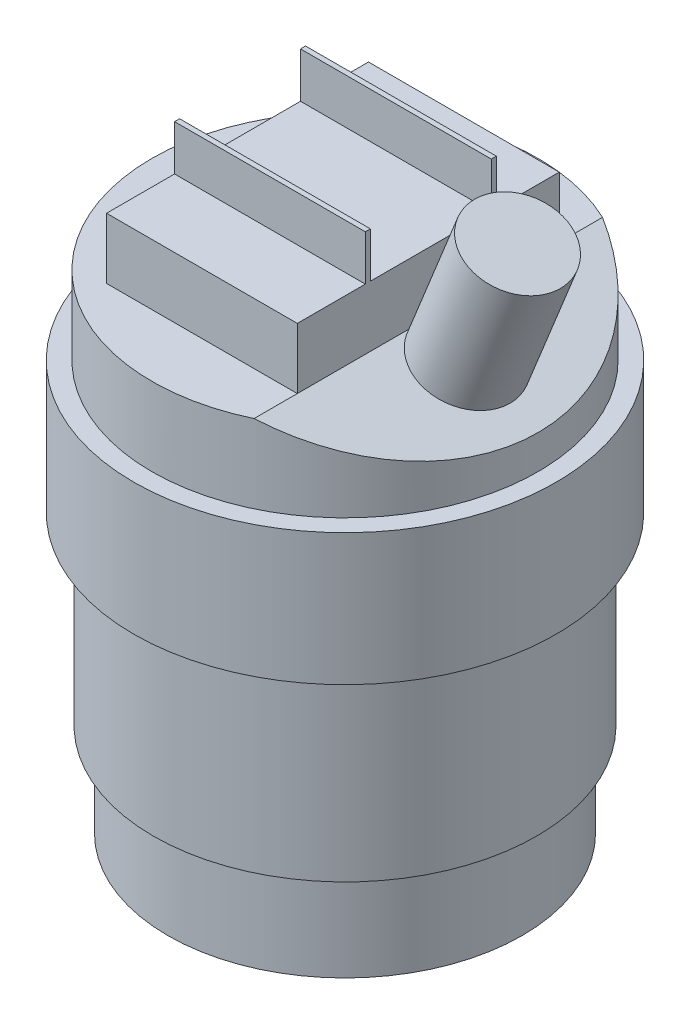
from build123d import *

# Parameters (mm, degrees)
SKETCH1_R               = 13.3985
EXTRUDE1_DEPTH          = 7.0612
SKETCH2_R               = 14.4907
EXTRUDE2_DEPTH          = 13.97
SKETCH3_R               = 15.9766
EXTRUDE3_DEPTH          = 9.9568
SKETCH4_R               = 14.605
EXTRUDE4_DEPTH          = 5.9182
CUT_EXTRUDE1_DEPTH      = 44.273214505
CUT_EXTRUDE1_DEPTH_BACK = 44.273214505
SKETCH6_W               = 14.4272
SKETCH6_H               = 19.812
EXTRUDE5_DEPTH          = 4.5974
SKETCH7_W               = 14.4272
SKETCH7_H               = 0.381
EXTRUDE6_DEPTH          = 3.429
SKETCH8_R               = 3.4925
EXTRUDE7_DEPTH          = 10.16


with BuildPart() as part:
    # Sketch1 → Extrude1 (new body)
    with BuildSketch(Plane(origin=(0, 0, 0), x_dir=(1, 0, 0), z_dir=(0, 1, 0))):
        with Locations(Location((0, 0, 0), (0, 0, 270))):
            Circle(SKETCH1_R)
    extrude(amount=EXTRUDE1_DEPTH)

    # Sketch2 → Extrude2 (add)
    with BuildSketch(Plane(origin=(0, 7.0612, 0), x_dir=(1, 0, 0), z_dir=(0, 1, 0))):
        with Locations(Location((0, 0, 0), (0, 0, 270))):
            Circle(SKETCH2_R)
    extrude(amount=EXTRUDE2_DEPTH)

    # Sketch3 → Extrude3 (add)
    with BuildSketch(Plane(origin=(0, 21.0312, 0), x_dir=(1, 0, 0), z_dir=(0, 1, 0))):
        with Locations(Location((0, 0, 0), (0, 0, 270))):
            Circle(SKETCH3_R)
    extrude(amount=EXTRUDE3_DEPTH)

    # Sketch4 → Extrude4 (add)
    with BuildSketch(Plane(origin=(0, 30.988, 0), x_dir=(1, 0, 0), z_dir=(0, 1, 0))):
        with Locations(Location((0, 0, 0), (0, 0, 270))):
            Circle(SKETCH4_R)
    extrude(amount=EXTRUDE4_DEPTH)

    # Sketch5 → Cut-Extrude1 (cut, two sides: drawn at the far end of the back side and taken through both)
    with BuildSketch(Plane.XY.offset(-CUT_EXTRUDE1_DEPTH_BACK)):
        Polygon((6.2992, 36.9062), (14.605, 33.550438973), (14.605, 36.9062), align=None)
    extrude(amount=CUT_EXTRUDE1_DEPTH + CUT_EXTRUDE1_DEPTH_BACK, mode=Mode.SUBTRACT)

    # Sketch6 → Extrude5 (add)
    with BuildSketch(Plane(origin=(0, 36.9062, 0), x_dir=(1, 0, 0), z_dir=(0, 1, 0))):
        with Locations((-0.9144, 0)):
            Rectangle(SKETCH6_W, SKETCH6_H)
    extrude(amount=EXTRUDE5_DEPTH)

    # Sketch7 → Extrude6 (add)
    with BuildSketch(Plane(origin=(0, 41.5036, 0), x_dir=(1, 0, 0), z_dir=(0, 1, 0))):
        with Locations((-0.9144, 4.953)):
            Rectangle(SKETCH7_W, SKETCH7_H)
        with Locations((-0.9144, -4.572)):
            Rectangle(SKETCH7_W, SKETCH7_H)
    extrude(amount=EXTRUDE6_DEPTH)

    # Sketch8 → Extrude7 (add)
    with BuildSketch(Plane(origin=(13.702567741, 33.915045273, 0), x_dir=(0.9271838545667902, -0.3746065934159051, 0), z_dir=(0.3746065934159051, 0.9271838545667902, 0))):
        with Locations(Location((-4.809789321, 0, 0), (0, 0, 155.380022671))):
            Circle(SKETCH8_R)
    extrude(amount=EXTRUDE7_DEPTH)


solid = part.part
